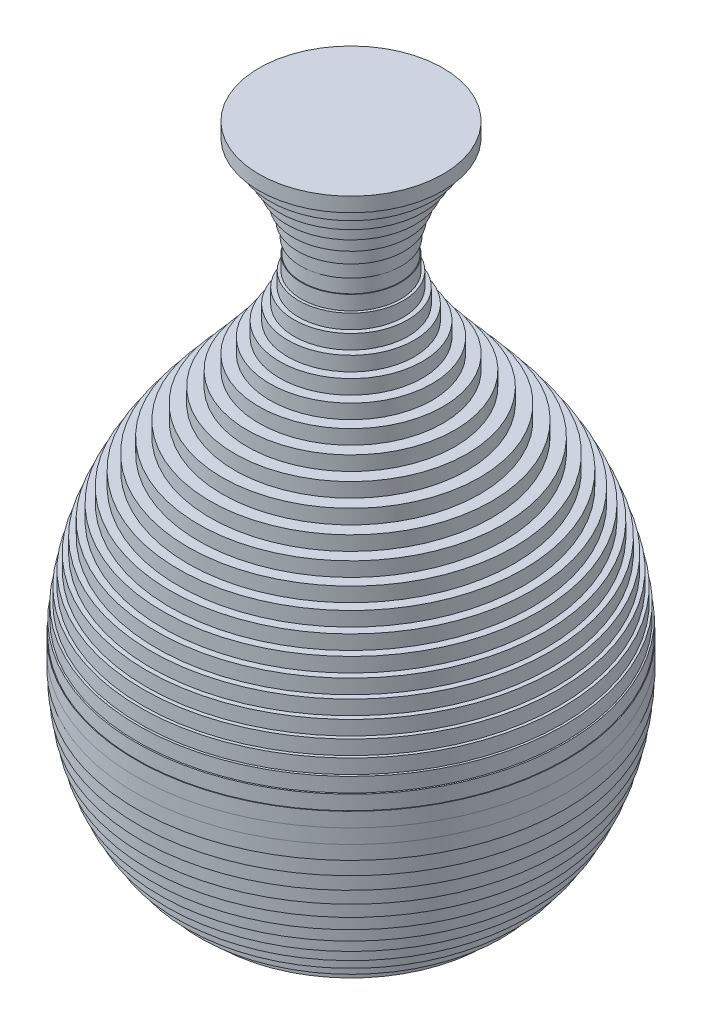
from build123d import *


with BuildPart() as part:
    # Sketch1 → Revolve1 (revolve)
    with BuildSketch(Plane.XY):
        Polygon((0, 225), (32, 225), (32, 220), (28.308998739, 220), (28.308998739, 215), (25.075686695, 215), (25.075686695, 210), (22.334957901, 210), (22.334957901, 205), (20.122976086, 205), (20.122976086, 200), (18.476197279, 200), (18.476197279, 195), (17.429848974, 195), (17.429848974, 190), (17.01570538, 190), (17.01570538, 185), (17.259017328, 185), (17.259017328, 180), (18.17454027, 180), (18.17454027, 175), (19.761793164, 175), (19.761793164, 170), (22, 170), (22, 165), (24.843584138, 165), (24.843584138, 160), (28.21946776, 160), (28.21946776, 155), (32.027523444, 155), (32.027523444, 150), (36.145070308, 150), (36.145070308, 145), (40.435259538, 145), (40.435259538, 140), (44.757913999, 140), (44.757913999, 135), (48.98052193, 135), (48.98052193, 130), (52.987124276, 130), (52.987124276, 125), (56.683719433, 125), (56.683719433, 120), (60, 120), (60, 115), (62.902598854, 115), (62.902598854, 110), (65.424560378, 110), (65.424560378, 105), (67.603181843, 105), (67.603181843, 100), (69.466228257, 100), (69.466228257, 95), (71.034389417, 95), (71.034389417, 90), (72.32287701, 90), (72.32287701, 85), (73.342478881, 85), (73.342478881, 80), (74.100251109, 80), (74.100251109, 75), (74.599953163, 75), (74.599953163, 70), (74.842286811, 70), (74.842286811, 65), (74.824970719, 65), (74.824970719, 60), (74.542661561, 60), (74.542661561, 55), (73.986714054, 55), (73.986714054, 50), (73.144752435, 50), (73.144752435, 45), (72, 45), (72, 40), (70.530274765, 40), (70.530274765, 35), (68.706496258, 35), (68.706496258, 30), (66.490438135, 30), (66.490438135, 25), (63.831255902, 25), (63.831255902, 20), (60.65991081, 20), (60.65991081, 15), (56.879735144, 15), (56.879735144, 10), (52.349319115, 10), (52.349319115, 5), (46.848393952, 5), (46.848393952, 0), (0, 0), align=None)
    revolve(axis=Axis((0, 0, 0), (0, 1, 0)))


solid = part.part
